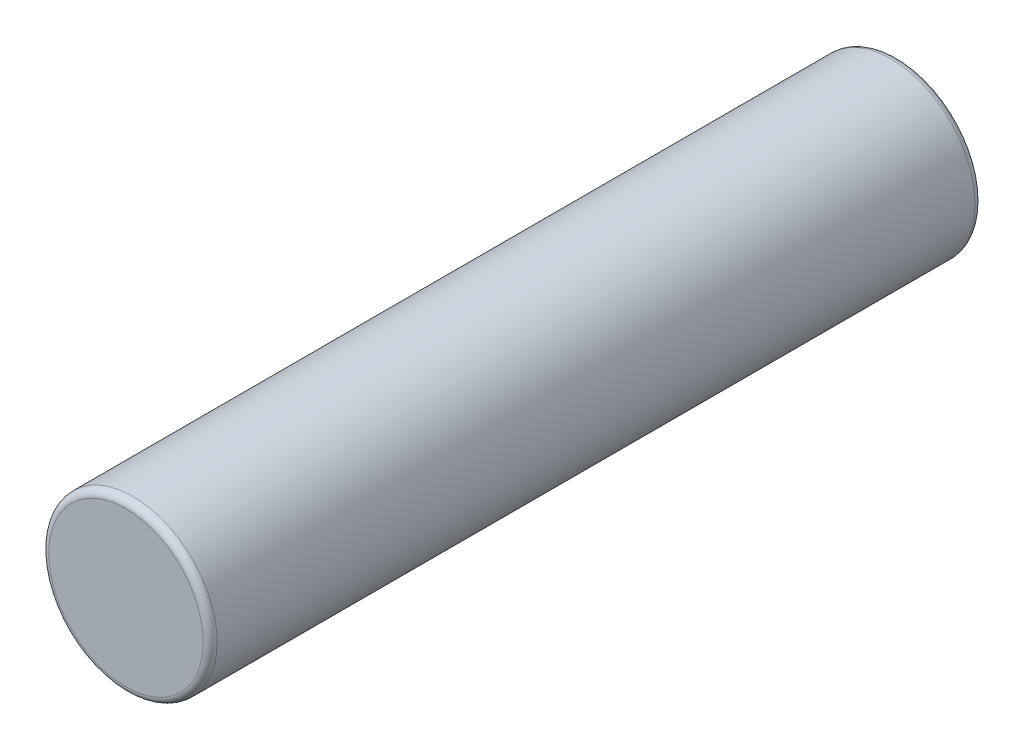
ISO-10303-21;
HEADER;
FILE_DESCRIPTION(('STEP AP214'),'2;1');
FILE_NAME('part.step','',(''),(''),'','','');
FILE_SCHEMA(('AUTOMOTIVE_DESIGN { 1 0 10303 214 1 1 1 1 }'));
ENDSEC;
DATA;
#1=APPLICATION_CONTEXT('core data for automotive mechanical design processes');
#2=APPLICATION_PROTOCOL_DEFINITION('international standard','automotive_design',2000,#1);
#3=PRODUCT_CONTEXT('',#1,'mechanical');
#4=PRODUCT('Part','Part','',(#3));
#5=PRODUCT_RELATED_PRODUCT_CATEGORY('part','',(#4));
#6=PRODUCT_DEFINITION_FORMATION('','',#4);
#7=PRODUCT_DEFINITION_CONTEXT('part definition',#1,'design');
#8=PRODUCT_DEFINITION('design','',#6,#7);
#9=PRODUCT_DEFINITION_SHAPE('','',#8);
#10=(LENGTH_UNIT() NAMED_UNIT(*) SI_UNIT(.MILLI.,.METRE.));
#11=(NAMED_UNIT(*) PLANE_ANGLE_UNIT() SI_UNIT($,.RADIAN.));
#12=(NAMED_UNIT(*) SI_UNIT($,.STERADIAN.) SOLID_ANGLE_UNIT());
#13=UNCERTAINTY_MEASURE_WITH_UNIT(LENGTH_MEASURE(1.E-05),#10,'distance_accuracy_value','');
#14=(GEOMETRIC_REPRESENTATION_CONTEXT(3) GLOBAL_UNCERTAINTY_ASSIGNED_CONTEXT((#13)) GLOBAL_UNIT_ASSIGNED_CONTEXT((#10,
#11,#12)) REPRESENTATION_CONTEXT('',''));
#15=CARTESIAN_POINT('',(0.,0.,0.));
#16=DIRECTION('',(0.,0.,1.));
#17=DIRECTION('',(1.,0.,0.));
#18=AXIS2_PLACEMENT_3D('',#15,#16,#17);
#19=CARTESIAN_POINT('',(0.,0.,55.));
#20=DIRECTION('',(0.,0.,-1.));
#21=DIRECTION('',(-1.,0.,0.));
#22=AXIS2_PLACEMENT_3D('',#19,#20,#21);
#23=CYLINDRICAL_SURFACE('',#22,12.);
#24=CARTESIAN_POINT('',(0.,0.,-54.));
#25=DIRECTION('',(0.,0.,1.));
#26=DIRECTION('',(1.,0.,0.));
#27=AXIS2_PLACEMENT_3D('',#24,#25,#26);
#28=CIRCLE('',#27,12.);
#29=CARTESIAN_POINT('',(12.,0.,-54.));
#30=VERTEX_POINT('',#29);
#31=EDGE_CURVE('E44',#30,#30,#28,.T.);
#32=ORIENTED_EDGE('',*,*,#31,.T.);
#33=EDGE_LOOP('',(#32));
#34=FACE_BOUND('',#33,.T.);
#35=CARTESIAN_POINT('',(0.,0.,54.));
#36=DIRECTION('',(0.,0.,1.));
#37=DIRECTION('',(1.,0.,0.));
#38=AXIS2_PLACEMENT_3D('',#35,#36,#37);
#39=CIRCLE('',#38,12.);
#40=CARTESIAN_POINT('',(12.,0.,54.));
#41=VERTEX_POINT('',#40);
#42=EDGE_CURVE('E48',#41,#41,#39,.F.);
#43=ORIENTED_EDGE('',*,*,#42,.T.);
#44=EDGE_LOOP('',(#43));
#45=FACE_BOUND('',#44,.T.);
#46=ADVANCED_FACE('F33',(#34,#45),#23,.T.);
#47=CARTESIAN_POINT('',(0.,0.,55.));
#48=DIRECTION('',(0.,0.,1.));
#49=DIRECTION('',(1.,0.,0.));
#50=AXIS2_PLACEMENT_3D('',#47,#48,#49);
#51=PLANE('',#50);
#52=CARTESIAN_POINT('',(0.,0.,55.));
#53=DIRECTION('',(0.,0.,1.));
#54=DIRECTION('',(1.,0.,0.));
#55=AXIS2_PLACEMENT_3D('',#52,#53,#54);
#56=CIRCLE('',#55,11.);
#57=CARTESIAN_POINT('',(11.,0.,55.));
#58=VERTEX_POINT('',#57);
#59=EDGE_CURVE('E10',#58,#58,#56,.T.);
#60=ORIENTED_EDGE('',*,*,#59,.T.);
#61=EDGE_LOOP('',(#60));
#62=FACE_BOUND('',#61,.T.);
#63=ADVANCED_FACE('F64',(#62),#51,.T.);
#64=CARTESIAN_POINT('',(0.,0.,-55.));
#65=DIRECTION('',(0.,0.,1.));
#66=DIRECTION('',(1.,0.,0.));
#67=AXIS2_PLACEMENT_3D('',#64,#65,#66);
#68=PLANE('',#67);
#69=CARTESIAN_POINT('',(0.,0.,-55.));
#70=DIRECTION('',(0.,0.,1.));
#71=DIRECTION('',(1.,0.,0.));
#72=AXIS2_PLACEMENT_3D('',#69,#70,#71);
#73=CIRCLE('',#72,11.);
#74=CARTESIAN_POINT('',(11.,0.,-55.));
#75=VERTEX_POINT('',#74);
#76=EDGE_CURVE('E40',#75,#75,#73,.F.);
#77=ORIENTED_EDGE('',*,*,#76,.T.);
#78=EDGE_LOOP('',(#77));
#79=FACE_BOUND('',#78,.T.);
#80=ADVANCED_FACE('F61',(#79),#68,.F.);
#81=CARTESIAN_POINT('',(0.,0.,-54.));
#82=DIRECTION('',(0.,0.,1.));
#83=DIRECTION('',(1.,0.,0.));
#84=AXIS2_PLACEMENT_3D('',#81,#82,#83);
#85=TOROIDAL_SURFACE('',#84,11.,1.);
#86=ORIENTED_EDGE('',*,*,#76,.F.);
#87=EDGE_LOOP('',(#86));
#88=FACE_BOUND('',#87,.T.);
#89=ORIENTED_EDGE('',*,*,#31,.F.);
#90=EDGE_LOOP('',(#89));
#91=FACE_BOUND('',#90,.T.);
#92=ADVANCED_FACE('F57',(#88,#91),#85,.T.);
#93=CARTESIAN_POINT('',(0.,0.,54.));
#94=DIRECTION('',(0.,0.,1.));
#95=DIRECTION('',(1.,0.,0.));
#96=AXIS2_PLACEMENT_3D('',#93,#94,#95);
#97=TOROIDAL_SURFACE('',#96,11.,1.);
#98=ORIENTED_EDGE('',*,*,#42,.F.);
#99=EDGE_LOOP('',(#98));
#100=FACE_BOUND('',#99,.T.);
#101=ORIENTED_EDGE('',*,*,#59,.F.);
#102=EDGE_LOOP('',(#101));
#103=FACE_BOUND('',#102,.T.);
#104=ADVANCED_FACE('F35',(#100,#103),#97,.T.);
#105=CLOSED_SHELL('',(#46,#63,#80,#92,#104));
#106=MANIFOLD_SOLID_BREP('B2',#105);
#107=ADVANCED_BREP_SHAPE_REPRESENTATION('',(#18,#106),#14);
#108=SHAPE_DEFINITION_REPRESENTATION(#9,#107);
ENDSEC;
END-ISO-10303-21;
